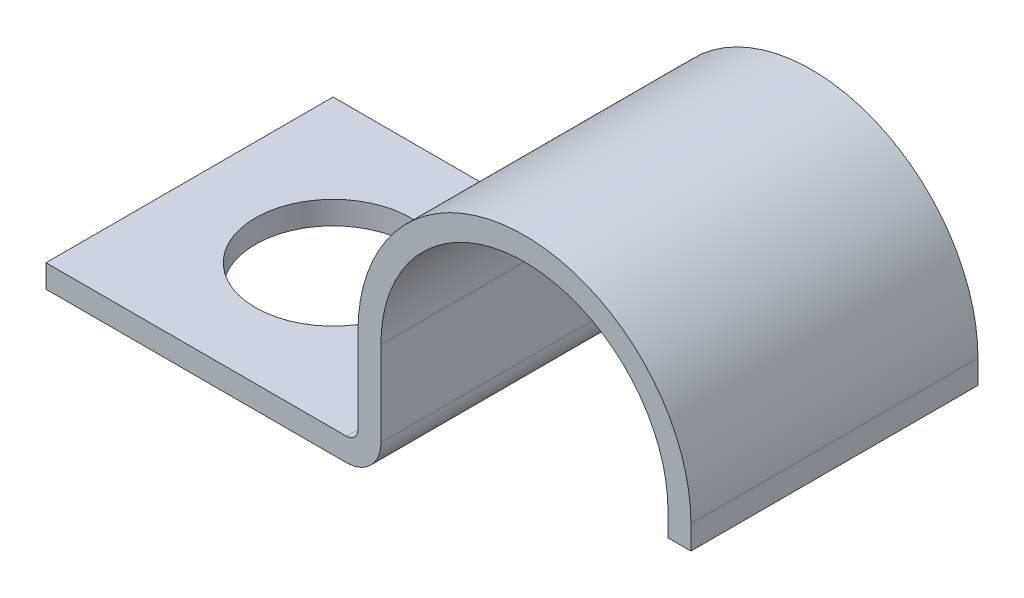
from build123d import *

# Parameters (mm, degrees)
EXTRUDE_THIN1_DEPTH = 9.525
SKETCH2_R           = 5.1562
CUT_EXTRUDE1_DEPTH  = 1.524


with BuildPart() as part:
    # Sketch1 → Extrude-Thin1 (new, symmetric)
    with BuildSketch(Plane.XY):
        with BuildLine():
            Line((0, 0), (19.939, 0))
            ThreePointArc((19.939, 0), (21.555446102, 0.669553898), (22.225, 2.286))
            Line((22.225, 2.286), (22.225, 7.9248))
            ThreePointArc((22.225, 7.9248), (31.75, 17.4498), (41.275, 7.9248))
            Line((41.275, 7.9248), (41.275, 6.35))
            Line((41.275, 6.35), (42.799, 6.35))
            Line((42.799, 6.35), (42.799, 7.9248))
            ThreePointArc((42.799, 7.9248), (31.75, 18.9738), (20.701, 7.9248))
            Line((20.701, 7.9248), (20.701, 2.286))
            ThreePointArc((20.701, 2.286), (20.477815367, 1.747184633), (19.939, 1.524))
            Line((19.939, 1.524), (0, 1.524))
            Line((0, 1.524), (0, 0))
        make_face()
    extrude(amount=EXTRUDE_THIN1_DEPTH, both=True)

    # Sketch2 → Cut-Extrude1 (cut)
    with BuildSketch(Plane(origin=(0, 1.524, 0), x_dir=(1, 0, 0), z_dir=(0, 1, 0))):
        with Locations(Location((9.525, 0, 0), (0, 0, 270))):
            Circle(SKETCH2_R)
    extrude(amount=-CUT_EXTRUDE1_DEPTH, mode=Mode.SUBTRACT)


solid = part.part
